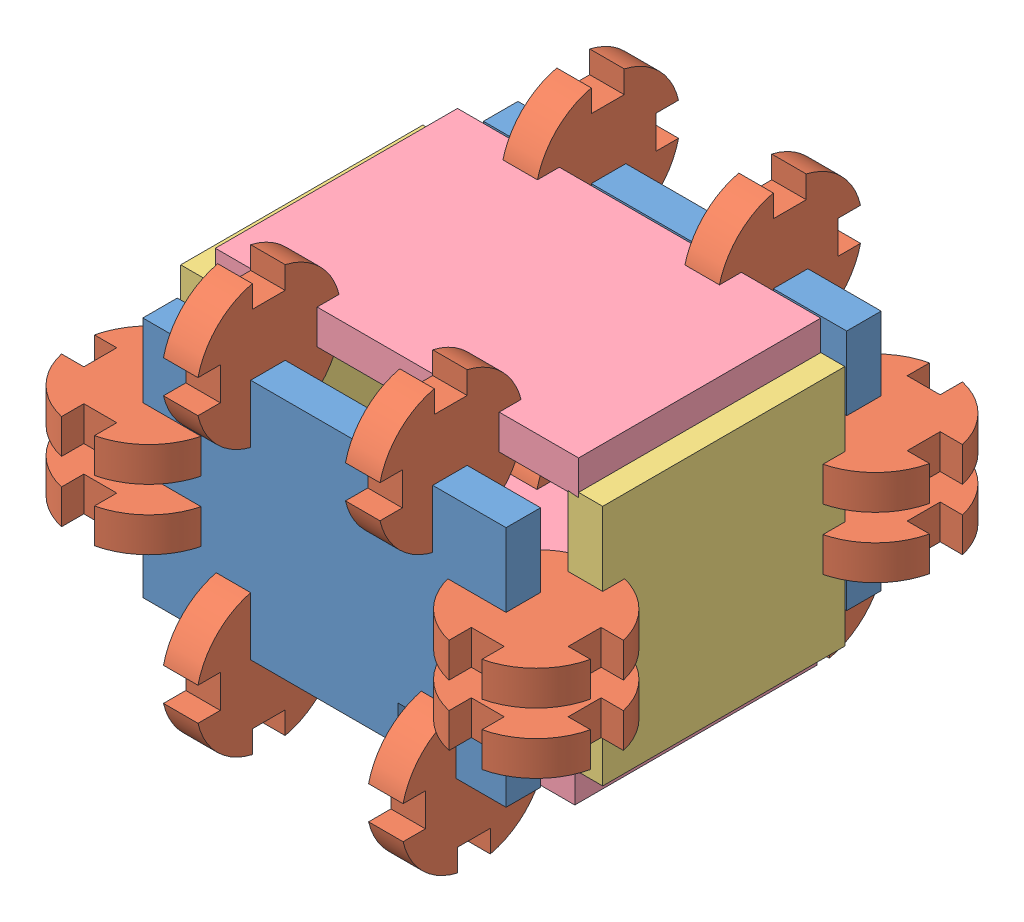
SolidWorks assembly Assem1.SLDASM, configuration Default (file format 9000). Lengths in mm.
Overall size (87.38 67.38 79.38).
22 component instances, 4 part files, 32 mates.
Components (placement in the parent):
- Part2-5: Part2.SLDPRT [Default] at (-673.5117 -2089.3626 725.3424) size (60 40 5.7)
- Part1-14: Part1.SLDPRT [Default] at (-639.6958 -2118.6551 728.3224) x (0 0 -1) z (1 0 0) size (23.38 23.38 5.7)
- Part1-15: Part1.SLDPRT [Default] at (-653.8142 -2104.5367 728.3224) x (-1 0 0) z (0 1 0) size (23.38 23.38 5.7)
- Part1-17: Part1.SLDPRT [Default] at (-605.815 -2118.6551 728.3224) x (0 0 -1) z (1 0 0) size (23.38 23.38 5.7)
- Part1-18: Part1.SLDPRT [Default] at (-589.8142 -2104.5367 728.3224) x (0 0 -1) z (0 1 0) size (23.38 23.38 5.7)
- Part1-19: Part1.SLDPRT [Default] at (-609.6325 -2074.6551 728.3224) x (0 0 -1) z (1 0 0) size (23.38 23.38 5.7)
- Part1-20: Part1.SLDPRT [Default] at (-589.8142 -2094.4734 728.3224) x (-1 0 0) z (0 1 0) size (23.38 23.38 5.7)
- Part1-21: Part1.SLDPRT [Default] at (-639.6958 -2074.6551 728.3224) x (0 0 -1) z (1 0 0) size (23.38 23.38 5.7)
- Part1-23: Part1.SLDPRT [Default] at (-653.8142 -2088.7734 728.3224) x (0 0 1) z (0 -1 0) size (23.38 23.38 5.7)
- Part4-1: Part4.SLDPRT [Default] at (-656.5342 -2153.7252 1010.5788) x (0 0 -1) z (1 0 0) size (40 40 5.7)
- Part4-2: Part4.SLDPRT [Default] at (-592.5342 -2153.4204 1010.5788) x (0 0 -1) z (1 0 0) size (40 40 5.7)
- Part3-2: Part3.SLDPRT [Default] at (-569.7463 -2121.6351 763.6148) x (-1 0 0) z (0 1 0) size (60 40 5.7)
- Part3-3: Part3.SLDPRT [Default] at (-569.1204 -2077.3751 763.6148) x (-1 0 0) z (0 1 0) size (60 40 5.7)
- Part2-7: Part2.SLDPRT [Default] at (-673.5117 -2089.3626 781.6024) size (60 40 5.7)
- Part1-24: Part1.SLDPRT [Default] at (-633.9958 -2118.6551 784.3224) x (0 0 1) z (-1 0 0) size (23.38 23.38 5.7)
- Part1-25: Part1.SLDPRT [Default] at (-653.8142 -2098.8367 784.3224) x (-1 0 0) z (0 -1 0) size (23.38 23.38 5.7)
- Part1-26: Part1.SLDPRT [Default] at (-600.115 -2118.6551 784.3224) x (0 0 1) z (-1 0 0) size (23.38 23.38 5.7)
- Part1-27: Part1.SLDPRT [Default] at (-589.8142 -2098.8367 784.3224) x (0 0 1) z (0 -1 0) size (23.38 23.38 5.7)
- Part1-28: Part1.SLDPRT [Default] at (-603.9325 -2074.6551 784.3224) x (0 0 1) z (-1 0 0) size (23.38 23.38 5.7)
- Part1-29: Part1.SLDPRT [Default] at (-589.8142 -2088.7734 784.3224) x (-1 0 0) z (0 -1 0) size (23.38 23.38 5.7)
- Part1-30: Part1.SLDPRT [Default] at (-633.9958 -2074.6551 784.3224) x (0 0 1) z (-1 0 0) size (23.38 23.38 5.7)
- Part1-31: Part1.SLDPRT [Default] at (-653.8142 -2094.4734 784.3224) x (0 0 -1) z (0 1 0) size (23.38 23.38 5.7)
Mates (geometry in assembly coordinates):
- Coincident5: coincident anti-aligned: plane of Part2-5 through (-639.6958 -2110.6551 721.0424) normal (0 -1 0); plane of Part1-14 through (-643.9958 -2110.6551 731.0424) normal (0 1 0)
- Coincident7: coincident anti-aligned: plane of Part2-5 through (-645.8142 -2104.5367 721.0424) normal (-1 0 0); plane of Part1-15 through (-645.8142 -2108.8367 725.6024) normal (1 0 0)
- Coincident8: coincident anti-aligned: plane of Part2-5 through (-651.8142 -2104.5367 721.0424) normal (0 1 0); plane of Part1-15 through (-653.8142 -2104.5367 728.3224) normal (0 -1 0)
- Coincident9: coincident anti-aligned: plane of Part2-5 through (-673.5117 -2089.3626 731.0424) normal (0 0 1); plane of Part1-15 through (-645.8142 -2108.8367 731.0424) normal (0 0 -1)
- Coincident10: coincident anti-aligned: plane of Part2-5 through (-639.6958 -2116.6551 721.0424) normal (1 0 0); plane of Part1-14 through (-639.6958 -2118.6551 728.3224) normal (-1 0 0)
- Coincident11: coincident anti-aligned: plane of Part2-5 through (-639.6958 -2110.6551 721.0424) normal (0 -1 0); plane of Part1-14 through (-643.9958 -2110.6551 731.0424) normal (0 1 0)
- Coincident12: coincident: plane of Part2-5 through (-673.5117 -2089.3626 731.0424) normal (0 0 1); moEndPointRef_w of Part1-14
- Coincident13: coincident anti-aligned: plane of Part2-5 through (-603.9325 -2110.6551 721.0424) normal (0 -1 0); plane of Part1-17 through (-610.115 -2110.6551 731.0424) normal (0 1 0)
- Coincident14: coincident anti-aligned: plane of Part2-5 through (-673.5117 -2089.3626 731.0424) normal (0 0 1); plane of Part1-17 through (-610.115 -2106.6551 731.0424) normal (0 0 -1)
- Coincident15: coincident anti-aligned: plane of Part2-5 through (-597.8142 -2104.5367 721.0424) normal (1 0 0); plane of Part1-18 through (-597.8142 -2108.8367 731.0424) normal (-1 0 0)
- Coincident16: coincident anti-aligned: plane of Part2-5 through (-591.8142 -2098.8367 721.0424) normal (0 -1 0); plane of Part1-18 through (-589.8142 -2098.8367 728.3224) normal (0 1 0)
- Coincident17: coincident anti-aligned: plane of Part2-5 through (-673.5117 -2089.3626 731.0424) normal (0 0 1); plane of Part1-18 through (-601.8142 -2108.8367 731.0424) normal (0 0 -1)
- Coincident18: coincident anti-aligned: plane of Part2-5 through (-603.9325 -2082.6551 721.0424) normal (0 1 0); plane of Part1-19 through (-613.9325 -2082.6551 725.6024) normal (0 -1 0)
- Coincident19: coincident anti-aligned: plane of Part2-5 through (-673.5117 -2089.3626 731.0424) normal (0 0 1); plane of Part1-19 through (-613.9325 -2082.6551 731.0424) normal (0 0 -1)
- Coincident20: coincident anti-aligned: plane of Part2-5 through (-609.6325 -2076.6551 721.0424) normal (1 0 0); plane of Part1-19 through (-609.6325 -2074.6551 728.3224) normal (-1 0 0)
- Coincident21: coincident anti-aligned: plane of Part2-5 through (-597.8142 -2088.7734 721.0424) normal (1 0 0); plane of Part1-20 through (-597.8142 -2098.7734 731.0424) normal (-1 0 0)
- Coincident22: coincident anti-aligned: plane of Part2-5 through (-673.5117 -2089.3626 731.0424) normal (0 0 1); plane of Part1-20 through (-601.8142 -2098.7734 731.0424) normal (0 0 -1)
- Coincident23: coincident anti-aligned: plane of Part2-5 through (-591.8142 -2088.7734 721.0424) normal (0 -1 0); plane of Part1-20 through (-589.8142 -2088.7734 728.3224) normal (0 1 0)
- Coincident24: coincident anti-aligned: plane of Part2-5 through (-639.6958 -2082.6551 721.0424) normal (0 1 0); plane of Part1-21 through (-643.9958 -2082.6551 725.6024) normal (0 -1 0)
- Coincident25: coincident anti-aligned: plane of Part2-5 through (-639.6958 -2076.6551 721.0424) normal (1 0 0); plane of Part1-21 through (-639.6958 -2074.6551 728.3224) normal (-1 0 0)
- Coincident26: coincident anti-aligned: plane of Part2-5 through (-673.5117 -2089.3626 731.0424) normal (0 0 1); plane of Part1-21 through (-643.9958 -2082.6551 731.0424) normal (0 0 -1)
- Coincident27: coincident anti-aligned: plane of Part2-5 through (-645.8142 -2088.7734 721.0424) normal (-1 0 0); plane of Part1-23 through (-645.8142 -2084.4734 731.0424) normal (1 0 0)
- Coincident29: coincident anti-aligned: plane of Part2-5 through (-673.5117 -2089.3626 731.0424) normal (0 0 1); plane of Part1-23 through (-641.8142 -2084.4734 731.0424) normal (0 0 -1)
- Coincident30: coincident anti-aligned: plane of Part2-5 through (-651.8142 -2094.4734 721.0424) normal (0 1 0); plane of Part1-23 through (-653.8142 -2094.4734 728.3224) normal (0 -1 0)
- Coincident31: coincident anti-aligned: plane of Part1-23 through (-656.5342 -2084.4734 736.3224) normal (0 0 1); plane of Part4-1 through (-650.8342 -2076.9086 736.3224) normal (0 0 -1)
- Coincident32: coincident anti-aligned: plane of Part1-23 through (-656.5342 -2084.4734 740.3224) normal (1 0 0); plane of Part4-1 through (-656.5342 -2153.7252 1010.5788) normal (-1 0 0)
- Coincident33: coincident anti-aligned: plane of Part1-18 through (-587.0942 -2108.8367 736.3224) normal (0 0 1); plane of Part4-2 through (-586.8342 -2076.6038 736.3224) normal (0 0 -1)
- Coincident34: coincident anti-aligned: plane of Part1-20 through (-592.5342 -2098.7734 736.3224) normal (1 0 0); plane of Part4-2 through (-592.5342 -2153.4204 1010.5788) normal (-1 0 0)
- Coincident35: coincident anti-aligned: plane of Part1-14 through (-643.9958 -2121.3751 736.3224) normal (0 0 1); plane of Part3-2 through (-591.4438 -2115.9351 736.3224) normal (0 0 -1)
- Coincident36: coincident anti-aligned: plane of Part1-14 through (-643.9958 -2115.9351 736.3224) normal (0 -1 0); plane of Part3-2 through (-569.7463 -2115.9351 763.6148) normal (0 1 0)
- Coincident37: coincident anti-aligned: plane of Part1-21 through (-643.9958 -2077.3751 736.3224) normal (0 0 1); plane of Part3-3 through (-590.818 -2071.6751 736.3224) normal (0 0 -1)
- Coincident38: coincident anti-aligned: plane of Part1-21 through (-643.9958 -2077.3751 740.3224) normal (0 1 0); plane of Part3-3 through (-569.1204 -2077.3751 763.6148) normal (0 -1 0)
